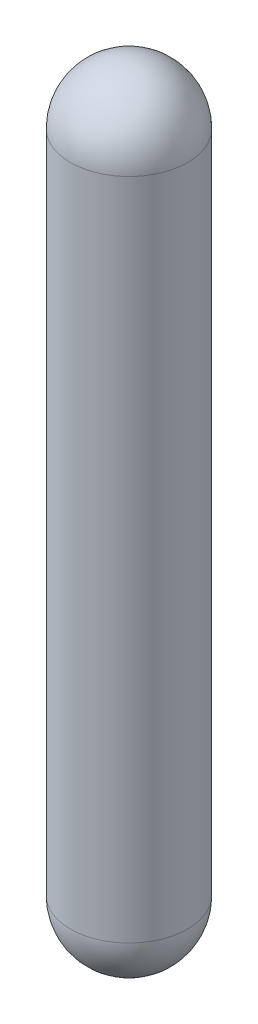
ISO-10303-21;
HEADER;
FILE_DESCRIPTION(('STEP AP214'),'2;1');
FILE_NAME('part.step','',(''),(''),'','','');
FILE_SCHEMA(('AUTOMOTIVE_DESIGN { 1 0 10303 214 1 1 1 1 }'));
ENDSEC;
DATA;
#1=APPLICATION_CONTEXT('core data for automotive mechanical design processes');
#2=APPLICATION_PROTOCOL_DEFINITION('international standard','automotive_design',2000,#1);
#3=PRODUCT_CONTEXT('',#1,'mechanical');
#4=PRODUCT('Part','Part','',(#3));
#5=PRODUCT_RELATED_PRODUCT_CATEGORY('part','',(#4));
#6=PRODUCT_DEFINITION_FORMATION('','',#4);
#7=PRODUCT_DEFINITION_CONTEXT('part definition',#1,'design');
#8=PRODUCT_DEFINITION('design','',#6,#7);
#9=PRODUCT_DEFINITION_SHAPE('','',#8);
#10=(LENGTH_UNIT() NAMED_UNIT(*) SI_UNIT(.MILLI.,.METRE.));
#11=(NAMED_UNIT(*) PLANE_ANGLE_UNIT() SI_UNIT($,.RADIAN.));
#12=(NAMED_UNIT(*) SI_UNIT($,.STERADIAN.) SOLID_ANGLE_UNIT());
#13=UNCERTAINTY_MEASURE_WITH_UNIT(LENGTH_MEASURE(1.E-05),#10,'distance_accuracy_value','');
#14=(GEOMETRIC_REPRESENTATION_CONTEXT(3) GLOBAL_UNCERTAINTY_ASSIGNED_CONTEXT((#13)) GLOBAL_UNIT_ASSIGNED_CONTEXT((#10,
#11,#12)) REPRESENTATION_CONTEXT('',''));
#15=CARTESIAN_POINT('',(0.,0.,0.));
#16=DIRECTION('',(0.,0.,1.));
#17=DIRECTION('',(1.,0.,0.));
#18=AXIS2_PLACEMENT_3D('',#15,#16,#17);
#19=CARTESIAN_POINT('',(-90.45,-137.5,0.));
#20=DIRECTION('',(0.,1.,0.));
#21=DIRECTION('',(0.,0.,-1.));
#22=AXIS2_PLACEMENT_3D('',#19,#20,#21);
#23=CYLINDRICAL_SURFACE('',#22,1.5);
#24=CARTESIAN_POINT('',(-90.45,-120.5,0.));
#25=DIRECTION('',(0.,1.,0.));
#26=DIRECTION('',(-1.,0.,0.));
#27=AXIS2_PLACEMENT_3D('',#24,#25,#26);
#28=CIRCLE('',#27,1.5);
#29=CARTESIAN_POINT('',(-90.45,-120.5,-1.5));
#30=VERTEX_POINT('',#29);
#31=CARTESIAN_POINT('',(-90.45,-120.5,1.5));
#32=VERTEX_POINT('',#31);
#33=EDGE_CURVE('E11',#30,#32,#28,.T.);
#34=ORIENTED_EDGE('',*,*,#33,.F.);
#35=CARTESIAN_POINT('',(-90.45,-120.5,0.));
#36=DIRECTION('',(0.,-1.,0.));
#37=DIRECTION('',(1.,0.,0.));
#38=AXIS2_PLACEMENT_3D('',#35,#36,#37);
#39=CIRCLE('',#38,1.5);
#40=EDGE_CURVE('E24',#30,#32,#39,.T.);
#41=ORIENTED_EDGE('',*,*,#40,.T.);
#42=EDGE_LOOP('',(#34,#41));
#43=FACE_BOUND('',#42,.T.);
#44=CARTESIAN_POINT('',(-90.45,-137.5,0.));
#45=DIRECTION('',(0.,1.,0.));
#46=DIRECTION('',(-1.,0.,0.));
#47=AXIS2_PLACEMENT_3D('',#44,#45,#46);
#48=CIRCLE('',#47,1.5);
#49=CARTESIAN_POINT('',(-90.45,-137.5,-1.5));
#50=VERTEX_POINT('',#49);
#51=CARTESIAN_POINT('',(-90.45,-137.5,1.5));
#52=VERTEX_POINT('',#51);
#53=EDGE_CURVE('E42',#50,#52,#48,.T.);
#54=ORIENTED_EDGE('',*,*,#53,.T.);
#55=CARTESIAN_POINT('',(-90.45,-137.5,0.));
#56=DIRECTION('',(0.,-1.,0.));
#57=DIRECTION('',(1.,0.,0.));
#58=AXIS2_PLACEMENT_3D('',#55,#56,#57);
#59=CIRCLE('',#58,1.5);
#60=EDGE_CURVE('E30',#50,#52,#59,.T.);
#61=ORIENTED_EDGE('',*,*,#60,.F.);
#62=EDGE_LOOP('',(#54,#61));
#63=FACE_BOUND('',#62,.T.);
#64=ADVANCED_FACE('F16',(#43,#63),#23,.T.);
#65=CARTESIAN_POINT('',(-90.45,-120.5,0.));
#66=DIRECTION('',(0.,0.,1.));
#67=DIRECTION('',(-1.,0.,0.));
#68=AXIS2_PLACEMENT_3D('',#65,#66,#67);
#69=SPHERICAL_SURFACE('',#68,1.5);
#70=CARTESIAN_POINT('',(-90.45,-120.5,0.));
#71=DIRECTION('',(0.,1.,0.));
#72=DIRECTION('',(-1.,0.,0.));
#73=AXIS2_PLACEMENT_3D('',#70,#71,#72);
#74=SPHERICAL_SURFACE('',#73,1.5);
#75=ORIENTED_EDGE('',*,*,#33,.T.);
#76=ORIENTED_EDGE('',*,*,#40,.F.);
#77=EDGE_LOOP('',(#75,#76));
#78=FACE_BOUND('',#77,.T.);
#79=ADVANCED_FACE('F80',(#78),#74,.T.);
#80=CARTESIAN_POINT('',(-90.45,-137.5,0.));
#81=DIRECTION('',(0.,0.,1.));
#82=DIRECTION('',(1.,0.,0.));
#83=AXIS2_PLACEMENT_3D('',#80,#81,#82);
#84=SPHERICAL_SURFACE('',#83,1.5);
#85=CARTESIAN_POINT('',(-90.45,-137.5,0.));
#86=DIRECTION('',(0.,-1.,0.));
#87=DIRECTION('',(1.,0.,0.));
#88=AXIS2_PLACEMENT_3D('',#85,#86,#87);
#89=SPHERICAL_SURFACE('',#88,1.5);
#90=ORIENTED_EDGE('',*,*,#60,.T.);
#91=ORIENTED_EDGE('',*,*,#53,.F.);
#92=EDGE_LOOP('',(#90,#91));
#93=FACE_BOUND('',#92,.T.);
#94=ADVANCED_FACE('F41',(#93),#89,.T.);
#95=CLOSED_SHELL('',(#64,#79,#94));
#96=MANIFOLD_SOLID_BREP('B1',#95);
#97=ADVANCED_BREP_SHAPE_REPRESENTATION('',(#18,#96),#14);
#98=SHAPE_DEFINITION_REPRESENTATION(#9,#97);
ENDSEC;
END-ISO-10303-21;
